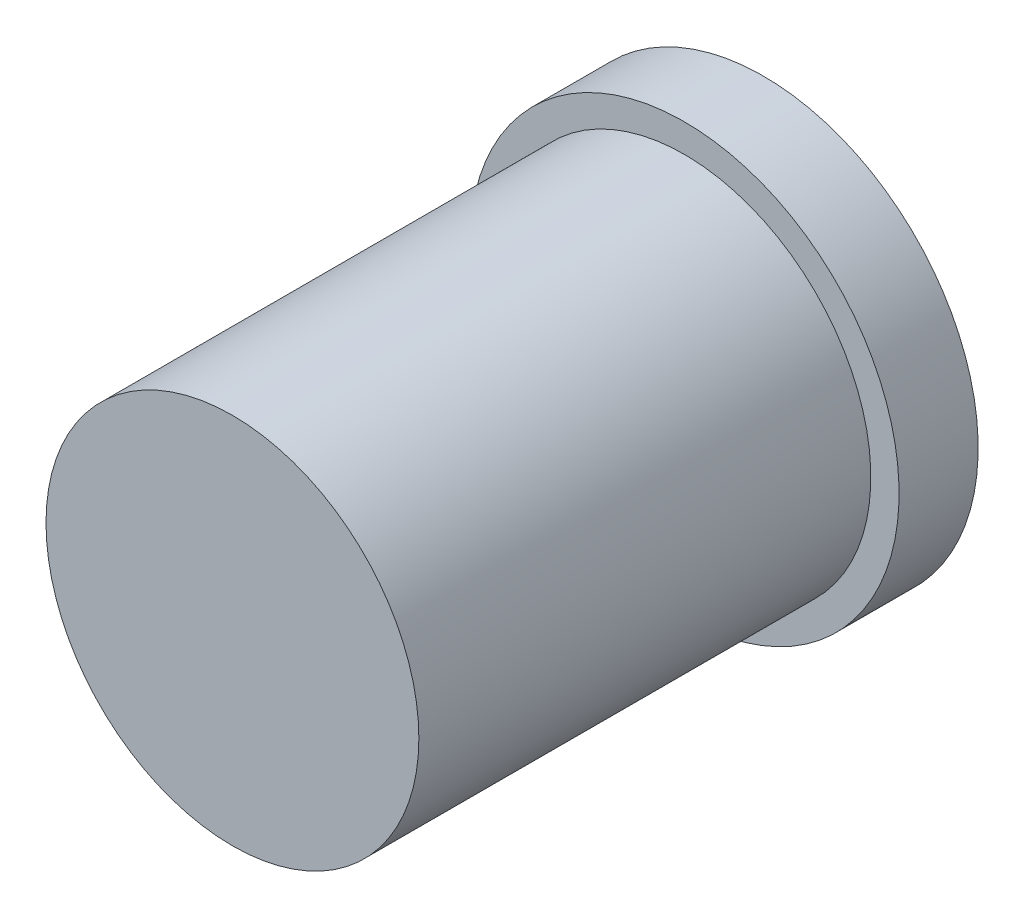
ISO-10303-21;
HEADER;
FILE_DESCRIPTION(('STEP AP214'),'2;1');
FILE_NAME('part.step','',(''),(''),'','','');
FILE_SCHEMA(('AUTOMOTIVE_DESIGN { 1 0 10303 214 1 1 1 1 }'));
ENDSEC;
DATA;
#1=APPLICATION_CONTEXT('core data for automotive mechanical design processes');
#2=APPLICATION_PROTOCOL_DEFINITION('international standard','automotive_design',2000,#1);
#3=PRODUCT_CONTEXT('',#1,'mechanical');
#4=PRODUCT('Part','Part','',(#3));
#5=PRODUCT_RELATED_PRODUCT_CATEGORY('part','',(#4));
#6=PRODUCT_DEFINITION_FORMATION('','',#4);
#7=PRODUCT_DEFINITION_CONTEXT('part definition',#1,'design');
#8=PRODUCT_DEFINITION('design','',#6,#7);
#9=PRODUCT_DEFINITION_SHAPE('','',#8);
#10=(LENGTH_UNIT() NAMED_UNIT(*) SI_UNIT(.MILLI.,.METRE.));
#11=(NAMED_UNIT(*) PLANE_ANGLE_UNIT() SI_UNIT($,.RADIAN.));
#12=(NAMED_UNIT(*) SI_UNIT($,.STERADIAN.) SOLID_ANGLE_UNIT());
#13=UNCERTAINTY_MEASURE_WITH_UNIT(LENGTH_MEASURE(1.E-05),#10,'distance_accuracy_value','');
#14=(GEOMETRIC_REPRESENTATION_CONTEXT(3) GLOBAL_UNCERTAINTY_ASSIGNED_CONTEXT((#13)) GLOBAL_UNIT_ASSIGNED_CONTEXT((#10,
#11,#12)) REPRESENTATION_CONTEXT('',''));
#15=CARTESIAN_POINT('',(0.,0.,0.));
#16=DIRECTION('',(0.,0.,1.));
#17=DIRECTION('',(1.,0.,0.));
#18=AXIS2_PLACEMENT_3D('',#15,#16,#17);
#19=CARTESIAN_POINT('',(0.,0.,-3.50000000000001));
#20=DIRECTION('',(0.,0.,-1.));
#21=DIRECTION('',(-1.,0.,0.));
#22=AXIS2_PLACEMENT_3D('',#19,#20,#21);
#23=PLANE('',#22);
#24=DIRECTION('',(-1.,0.,0.));
#25=VECTOR('',#24,1.);
#26=CARTESIAN_POINT('',(4.49999999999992,4.,-3.50000000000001));
#27=LINE('',#26,#25);
#28=CARTESIAN_POINT('',(4.49999999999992,4.,-3.50000000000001));
#29=VERTEX_POINT('',#28);
#30=CARTESIAN_POINT('',(-4.50000000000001,3.99999999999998,-3.50000000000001));
#31=VERTEX_POINT('',#30);
#32=EDGE_CURVE('E295',#29,#31,#27,.T.);
#33=ORIENTED_EDGE('',*,*,#32,.F.);
#34=CARTESIAN_POINT('',(4.49999999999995,3.5,-3.5));
#35=DIRECTION('',(0.,0.,1.));
#36=DIRECTION('',(-1.,0.,0.));
#37=AXIS2_PLACEMENT_3D('',#34,#35,#36);
#38=CIRCLE('',#37,0.500000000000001);
#39=CARTESIAN_POINT('',(4.99999999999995,3.5,-3.50000000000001));
#40=VERTEX_POINT('',#39);
#41=EDGE_CURVE('E207',#40,#29,#38,.T.);
#42=ORIENTED_EDGE('',*,*,#41,.F.);
#43=DIRECTION('',(0.,1.,0.));
#44=VECTOR('',#43,1.);
#45=CARTESIAN_POINT('',(4.99999999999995,3.5,-3.50000000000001));
#46=LINE('',#45,#44);
#47=CARTESIAN_POINT('',(4.99999999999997,1.50000000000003,-3.50000000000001));
#48=VERTEX_POINT('',#47);
#49=EDGE_CURVE('E315',#48,#40,#46,.T.);
#50=ORIENTED_EDGE('',*,*,#49,.F.);
#51=CARTESIAN_POINT('',(5.99999999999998,1.50000000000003,-3.5));
#52=DIRECTION('',(0.,0.,-1.));
#53=DIRECTION('',(1.,0.,0.));
#54=AXIS2_PLACEMENT_3D('',#51,#52,#53);
#55=CIRCLE('',#54,1.);
#56=CARTESIAN_POINT('',(6.,0.5,-3.5));
#57=VERTEX_POINT('',#56);
#58=EDGE_CURVE('E313',#57,#48,#55,.T.);
#59=ORIENTED_EDGE('',*,*,#58,.F.);
#60=DIRECTION('',(-1.,0.,0.));
#61=VECTOR('',#60,1.);
#62=CARTESIAN_POINT('',(6.83739716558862,0.5,-3.50000000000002));
#63=LINE('',#62,#61);
#64=CARTESIAN_POINT('',(6.83739716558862,0.5,-3.50000000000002));
#65=VERTEX_POINT('',#64);
#66=EDGE_CURVE('E311',#65,#57,#63,.T.);
#67=ORIENTED_EDGE('',*,*,#66,.F.);
#68=CARTESIAN_POINT('',(6.83739716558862,1.49999999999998,-3.50000000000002));
#69=DIRECTION('',(0.,0.,-1.));
#70=DIRECTION('',(1.,0.,0.));
#71=AXIS2_PLACEMENT_3D('',#68,#69,#70);
#72=CIRCLE('',#71,1.);
#73=CARTESIAN_POINT('',(7.81416818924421,1.7142857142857,-3.50000000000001));
#74=VERTEX_POINT('',#73);
#75=EDGE_CURVE('E309',#74,#65,#72,.T.);
#76=ORIENTED_EDGE('',*,*,#75,.F.);
#77=CARTESIAN_POINT('',(0.,0.,-3.50000000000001));
#78=DIRECTION('',(0.,0.,-1.));
#79=DIRECTION('',(-1.,0.,0.));
#80=AXIS2_PLACEMENT_3D('',#77,#78,#79);
#81=CIRCLE('',#80,8.);
#82=CARTESIAN_POINT('',(-7.81416818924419,1.7142857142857,-3.50000000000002));
#83=VERTEX_POINT('',#82);
#84=EDGE_CURVE('E307',#83,#74,#81,.T.);
#85=ORIENTED_EDGE('',*,*,#84,.F.);
#86=CARTESIAN_POINT('',(-6.83739716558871,1.50000000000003,-3.50000000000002));
#87=DIRECTION('',(0.,0.,-1.));
#88=DIRECTION('',(-1.,0.,0.));
#89=AXIS2_PLACEMENT_3D('',#86,#87,#88);
#90=CIRCLE('',#89,1.);
#91=CARTESIAN_POINT('',(-6.83739716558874,0.5,-3.50000000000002));
#92=VERTEX_POINT('',#91);
#93=EDGE_CURVE('E305',#92,#83,#90,.T.);
#94=ORIENTED_EDGE('',*,*,#93,.F.);
#95=DIRECTION('',(-1.,0.,0.));
#96=VECTOR('',#95,1.);
#97=CARTESIAN_POINT('',(-6.00000000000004,0.500000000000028,-3.50000000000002));
#98=LINE('',#97,#96);
#99=CARTESIAN_POINT('',(-6.00000000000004,0.500000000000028,-3.50000000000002));
#100=VERTEX_POINT('',#99);
#101=EDGE_CURVE('E303',#100,#92,#98,.T.);
#102=ORIENTED_EDGE('',*,*,#101,.F.);
#103=CARTESIAN_POINT('',(-6.00000000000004,1.5,-3.50000000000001));
#104=DIRECTION('',(0.,0.,-1.));
#105=DIRECTION('',(1.,0.,0.));
#106=AXIS2_PLACEMENT_3D('',#103,#104,#105);
#107=CIRCLE('',#106,0.999999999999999);
#108=CARTESIAN_POINT('',(-5.00000000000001,1.50000000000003,-3.50000000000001));
#109=VERTEX_POINT('',#108);
#110=EDGE_CURVE('E301',#109,#100,#107,.T.);
#111=ORIENTED_EDGE('',*,*,#110,.F.);
#112=DIRECTION('',(0.,-1.,0.));
#113=VECTOR('',#112,1.);
#114=CARTESIAN_POINT('',(-5.00000000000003,3.49999999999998,-3.50000000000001));
#115=LINE('',#114,#113);
#116=CARTESIAN_POINT('',(-5.00000000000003,3.49999999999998,-3.50000000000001));
#117=VERTEX_POINT('',#116);
#118=EDGE_CURVE('E299',#117,#109,#115,.T.);
#119=ORIENTED_EDGE('',*,*,#118,.F.);
#120=CARTESIAN_POINT('',(-4.50000000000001,3.49999999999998,-3.50000000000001));
#121=DIRECTION('',(0.,0.,1.));
#122=DIRECTION('',(-1.,0.,0.));
#123=AXIS2_PLACEMENT_3D('',#120,#121,#122);
#124=CIRCLE('',#123,0.5);
#125=EDGE_CURVE('E297',#31,#117,#124,.T.);
#126=ORIENTED_EDGE('',*,*,#125,.F.);
#127=EDGE_LOOP('',(#33,#42,#50,#59,#67,#76,#85,#94,#102,#111,#119,#126));
#128=FACE_BOUND('',#127,.T.);
#129=CARTESIAN_POINT('',(0.,0.,-3.50000000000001));
#130=DIRECTION('',(0.,0.,-1.));
#131=DIRECTION('',(-1.,0.,0.));
#132=AXIS2_PLACEMENT_3D('',#129,#130,#131);
#133=CIRCLE('',#132,9.5);
#134=CARTESIAN_POINT('',(-9.5,0.,-3.50000000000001));
#135=VERTEX_POINT('',#134);
#136=EDGE_CURVE('E378',#135,#135,#133,.T.);
#137=ORIENTED_EDGE('',*,*,#136,.T.);
#138=EDGE_LOOP('',(#137));
#139=FACE_BOUND('',#138,.T.);
#140=DIRECTION('',(1.,0.,0.));
#141=VECTOR('',#140,1.);
#142=CARTESIAN_POINT('',(4.5,-4.,-3.50000000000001));
#143=LINE('',#142,#141);
#144=CARTESIAN_POINT('',(-4.50000000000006,-4.00000000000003,-3.50000000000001));
#145=VERTEX_POINT('',#144);
#146=CARTESIAN_POINT('',(4.5,-4.,-3.50000000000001));
#147=VERTEX_POINT('',#146);
#148=EDGE_CURVE('E201',#145,#147,#143,.T.);
#149=ORIENTED_EDGE('',*,*,#148,.F.);
#150=CARTESIAN_POINT('',(-4.49999999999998,-3.49999999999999,-3.50000000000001));
#151=DIRECTION('',(0.,0.,1.));
#152=DIRECTION('',(-1.,0.,0.));
#153=AXIS2_PLACEMENT_3D('',#150,#151,#152);
#154=CIRCLE('',#153,0.5);
#155=CARTESIAN_POINT('',(-5.00000000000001,-3.49999999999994,-3.50000000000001));
#156=VERTEX_POINT('',#155);
#157=EDGE_CURVE('E212',#156,#145,#154,.T.);
#158=ORIENTED_EDGE('',*,*,#157,.F.);
#159=DIRECTION('',(0.,-1.,0.));
#160=VECTOR('',#159,1.);
#161=CARTESIAN_POINT('',(-5.00000000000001,-1.49999999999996,-3.50000000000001));
#162=LINE('',#161,#160);
#163=CARTESIAN_POINT('',(-5.00000000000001,-1.49999999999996,-3.50000000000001));
#164=VERTEX_POINT('',#163);
#165=EDGE_CURVE('E241',#164,#156,#162,.T.);
#166=ORIENTED_EDGE('',*,*,#165,.F.);
#167=CARTESIAN_POINT('',(-6.00000000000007,-1.49999999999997,-3.5));
#168=DIRECTION('',(0.,0.,-1.));
#169=DIRECTION('',(1.,0.,0.));
#170=AXIS2_PLACEMENT_3D('',#167,#168,#169);
#171=CIRCLE('',#170,1.);
#172=CARTESIAN_POINT('',(-6.00000000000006,-0.5,-3.50000000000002));
#173=VERTEX_POINT('',#172);
#174=EDGE_CURVE('E239',#173,#164,#171,.T.);
#175=ORIENTED_EDGE('',*,*,#174,.F.);
#176=DIRECTION('',(1.,0.,0.));
#177=VECTOR('',#176,1.);
#178=CARTESIAN_POINT('',(-6.00000000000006,-0.5,-3.50000000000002));
#179=LINE('',#178,#177);
#180=CARTESIAN_POINT('',(-6.83739716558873,-0.499999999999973,-3.50000000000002));
#181=VERTEX_POINT('',#180);
#182=EDGE_CURVE('E237',#181,#173,#179,.T.);
#183=ORIENTED_EDGE('',*,*,#182,.F.);
#184=CARTESIAN_POINT('',(-6.83739716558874,-1.5,-3.50000000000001));
#185=DIRECTION('',(0.,0.,-1.));
#186=DIRECTION('',(-1.,0.,0.));
#187=AXIS2_PLACEMENT_3D('',#184,#185,#186);
#188=CIRCLE('',#187,1.);
#189=CARTESIAN_POINT('',(-7.81416818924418,-1.71428571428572,-3.5));
#190=VERTEX_POINT('',#189);
#191=EDGE_CURVE('E235',#190,#181,#188,.T.);
#192=ORIENTED_EDGE('',*,*,#191,.F.);
#193=CARTESIAN_POINT('',(0.,0.,-3.50000000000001));
#194=DIRECTION('',(0.,0.,-1.));
#195=DIRECTION('',(-1.,0.,0.));
#196=AXIS2_PLACEMENT_3D('',#193,#194,#195);
#197=CIRCLE('',#196,8.);
#198=CARTESIAN_POINT('',(7.81416818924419,-1.71428571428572,-3.50000000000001));
#199=VERTEX_POINT('',#198);
#200=EDGE_CURVE('E233',#199,#190,#197,.T.);
#201=ORIENTED_EDGE('',*,*,#200,.F.);
#202=CARTESIAN_POINT('',(6.83739716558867,-1.5,-3.50000000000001));
#203=DIRECTION('',(0.,0.,-1.));
#204=DIRECTION('',(1.,0.,0.));
#205=AXIS2_PLACEMENT_3D('',#202,#203,#204);
#206=CIRCLE('',#205,1.);
#207=CARTESIAN_POINT('',(6.83739716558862,-0.500000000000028,-3.50000000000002));
#208=VERTEX_POINT('',#207);
#209=EDGE_CURVE('E231',#208,#199,#206,.T.);
#210=ORIENTED_EDGE('',*,*,#209,.F.);
#211=DIRECTION('',(1.,0.,0.));
#212=VECTOR('',#211,1.);
#213=CARTESIAN_POINT('',(6.83739716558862,-0.500000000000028,-3.50000000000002));
#214=LINE('',#213,#212);
#215=CARTESIAN_POINT('',(6.00000000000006,-0.500000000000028,-3.5));
#216=VERTEX_POINT('',#215);
#217=EDGE_CURVE('E229',#216,#208,#214,.T.);
#218=ORIENTED_EDGE('',*,*,#217,.F.);
#219=CARTESIAN_POINT('',(6.00000000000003,-1.5,-3.5));
#220=DIRECTION('',(0.,0.,-1.));
#221=DIRECTION('',(-1.,0.,0.));
#222=AXIS2_PLACEMENT_3D('',#219,#220,#221);
#223=CIRCLE('',#222,1.);
#224=CARTESIAN_POINT('',(4.99999999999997,-1.5,-3.50000000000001));
#225=VERTEX_POINT('',#224);
#226=EDGE_CURVE('E227',#225,#216,#223,.T.);
#227=ORIENTED_EDGE('',*,*,#226,.F.);
#228=DIRECTION('',(0.,1.,0.));
#229=VECTOR('',#228,1.);
#230=CARTESIAN_POINT('',(4.99999999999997,-1.5,-3.50000000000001));
#231=LINE('',#230,#229);
#232=CARTESIAN_POINT('',(4.99999999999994,-3.49999999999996,-3.50000000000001));
#233=VERTEX_POINT('',#232);
#234=EDGE_CURVE('E223',#233,#225,#231,.T.);
#235=ORIENTED_EDGE('',*,*,#234,.F.);
#236=CARTESIAN_POINT('',(4.5,-3.49999999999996,-3.50000000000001));
#237=DIRECTION('',(0.,0.,1.));
#238=DIRECTION('',(1.,0.,0.));
#239=AXIS2_PLACEMENT_3D('',#236,#237,#238);
#240=CIRCLE('',#239,0.5);
#241=EDGE_CURVE('E221',#147,#233,#240,.T.);
#242=ORIENTED_EDGE('',*,*,#241,.F.);
#243=EDGE_LOOP('',(#149,#158,#166,#175,#183,#192,#201,#210,#218,#227,#235,#242));
#244=FACE_BOUND('',#243,.T.);
#245=ADVANCED_FACE('F34',(#128,#139,#244),#23,.T.);
#246=CARTESIAN_POINT('',(0.,0.,20.));
#247=DIRECTION('',(0.,0.,-1.));
#248=DIRECTION('',(-1.,0.,0.));
#249=AXIS2_PLACEMENT_3D('',#246,#247,#248);
#250=CYLINDRICAL_SURFACE('',#249,8.25);
#251=CARTESIAN_POINT('',(0.,0.,20.));
#252=DIRECTION('',(0.,0.,1.));
#253=DIRECTION('',(1.,0.,0.));
#254=AXIS2_PLACEMENT_3D('',#251,#252,#253);
#255=CIRCLE('',#254,8.25);
#256=CARTESIAN_POINT('',(8.25,0.,20.));
#257=VERTEX_POINT('',#256);
#258=EDGE_CURVE('E11',#257,#257,#255,.T.);
#259=ORIENTED_EDGE('',*,*,#258,.F.);
#260=EDGE_LOOP('',(#259));
#261=FACE_BOUND('',#260,.T.);
#262=CARTESIAN_POINT('',(0.,0.,0.));
#263=DIRECTION('',(0.,0.,-1.));
#264=DIRECTION('',(-1.,0.,0.));
#265=AXIS2_PLACEMENT_3D('',#262,#263,#264);
#266=CIRCLE('',#265,8.25);
#267=CARTESIAN_POINT('',(-8.25,0.,0.));
#268=VERTEX_POINT('',#267);
#269=EDGE_CURVE('E42',#268,#268,#266,.T.);
#270=ORIENTED_EDGE('',*,*,#269,.F.);
#271=EDGE_LOOP('',(#270));
#272=FACE_BOUND('',#271,.T.);
#273=ADVANCED_FACE('F36',(#261,#272),#250,.T.);
#274=CARTESIAN_POINT('',(0.,0.,20.));
#275=DIRECTION('',(0.,0.,1.));
#276=DIRECTION('',(1.,0.,0.));
#277=AXIS2_PLACEMENT_3D('',#274,#275,#276);
#278=PLANE('',#277);
#279=ORIENTED_EDGE('',*,*,#258,.T.);
#280=EDGE_LOOP('',(#279));
#281=FACE_BOUND('',#280,.T.);
#282=ADVANCED_FACE('F386',(#281),#278,.T.);
#283=CARTESIAN_POINT('',(0.,0.,0.));
#284=DIRECTION('',(0.,0.,-1.));
#285=DIRECTION('',(-1.,0.,0.));
#286=AXIS2_PLACEMENT_3D('',#283,#284,#285);
#287=PLANE('',#286);
#288=CARTESIAN_POINT('',(0.,0.,0.));
#289=DIRECTION('',(0.,0.,-1.));
#290=DIRECTION('',(-1.,0.,0.));
#291=AXIS2_PLACEMENT_3D('',#288,#289,#290);
#292=CIRCLE('',#291,9.5);
#293=CARTESIAN_POINT('',(-9.5,0.,0.));
#294=VERTEX_POINT('',#293);
#295=EDGE_CURVE('E375',#294,#294,#292,.T.);
#296=ORIENTED_EDGE('',*,*,#295,.F.);
#297=EDGE_LOOP('',(#296));
#298=FACE_BOUND('',#297,.T.);
#299=ORIENTED_EDGE('',*,*,#269,.T.);
#300=EDGE_LOOP('',(#299));
#301=FACE_BOUND('',#300,.T.);
#302=ADVANCED_FACE('F383',(#298,#301),#287,.F.);
#303=CARTESIAN_POINT('',(0.,0.,-3.50000000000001));
#304=DIRECTION('',(0.,0.,1.));
#305=DIRECTION('',(1.,0.,0.));
#306=AXIS2_PLACEMENT_3D('',#303,#304,#305);
#307=CYLINDRICAL_SURFACE('',#306,9.5);
#308=ORIENTED_EDGE('',*,*,#136,.F.);
#309=EDGE_LOOP('',(#308));
#310=FACE_BOUND('',#309,.T.);
#311=ORIENTED_EDGE('',*,*,#295,.T.);
#312=EDGE_LOOP('',(#311));
#313=FACE_BOUND('',#312,.T.);
#314=ADVANCED_FACE('F403',(#310,#313),#307,.T.);
#315=CARTESIAN_POINT('',(4.50000000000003,3.49999999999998,-4.50000000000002));
#316=DIRECTION('',(0.,0.,1.));
#317=DIRECTION('',(1.,0.,0.));
#318=AXIS2_PLACEMENT_3D('',#315,#316,#317);
#319=CYLINDRICAL_SURFACE('',#318,0.500000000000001);
#320=ORIENTED_EDGE('',*,*,#41,.T.);
#321=DIRECTION('',(0.,0.,1.));
#322=VECTOR('',#321,1.);
#323=CARTESIAN_POINT('',(4.49999999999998,3.99999999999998,-4.50000000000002));
#324=LINE('',#323,#322);
#325=CARTESIAN_POINT('',(4.49999999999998,3.99999999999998,-4.50000000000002));
#326=VERTEX_POINT('',#325);
#327=EDGE_CURVE('E373',#326,#29,#324,.T.);
#328=ORIENTED_EDGE('',*,*,#327,.F.);
#329=CARTESIAN_POINT('',(4.50000000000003,3.49999999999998,-4.50000000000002));
#330=DIRECTION('',(0.,0.,1.));
#331=DIRECTION('',(-1.,0.,0.));
#332=AXIS2_PLACEMENT_3D('',#329,#330,#331);
#333=CIRCLE('',#332,0.500000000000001);
#334=CARTESIAN_POINT('',(5.00000000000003,3.5,-4.50000000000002));
#335=VERTEX_POINT('',#334);
#336=EDGE_CURVE('E317',#335,#326,#333,.T.);
#337=ORIENTED_EDGE('',*,*,#336,.F.);
#338=DIRECTION('',(0.,0.,1.));
#339=VECTOR('',#338,1.);
#340=CARTESIAN_POINT('',(5.00000000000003,3.5,-4.50000000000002));
#341=LINE('',#340,#339);
#342=EDGE_CURVE('E342',#335,#40,#341,.T.);
#343=ORIENTED_EDGE('',*,*,#342,.T.);
#344=EDGE_LOOP('',(#320,#328,#337,#343));
#345=FACE_BOUND('',#344,.T.);
#346=ADVANCED_FACE('F405',(#345),#319,.F.);
#347=CARTESIAN_POINT('',(4.49999999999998,3.99999999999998,-4.50000000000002));
#348=DIRECTION('',(0.,1.,0.));
#349=DIRECTION('',(0.,0.,1.));
#350=AXIS2_PLACEMENT_3D('',#347,#348,#349);
#351=PLANE('',#350);
#352=ORIENTED_EDGE('',*,*,#32,.T.);
#353=DIRECTION('',(0.,0.,1.));
#354=VECTOR('',#353,1.);
#355=CARTESIAN_POINT('',(-4.50000000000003,3.99999999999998,-4.50000000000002));
#356=LINE('',#355,#354);
#357=CARTESIAN_POINT('',(-4.50000000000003,3.99999999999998,-4.50000000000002));
#358=VERTEX_POINT('',#357);
#359=EDGE_CURVE('E370',#358,#31,#356,.T.);
#360=ORIENTED_EDGE('',*,*,#359,.F.);
#361=DIRECTION('',(-1.,0.,0.));
#362=VECTOR('',#361,1.);
#363=CARTESIAN_POINT('',(4.49999999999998,3.99999999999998,-4.50000000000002));
#364=LINE('',#363,#362);
#365=EDGE_CURVE('E320',#326,#358,#364,.T.);
#366=ORIENTED_EDGE('',*,*,#365,.F.);
#367=ORIENTED_EDGE('',*,*,#327,.T.);
#368=EDGE_LOOP('',(#352,#360,#366,#367));
#369=FACE_BOUND('',#368,.T.);
#370=ADVANCED_FACE('F411',(#369),#351,.F.);
#371=CARTESIAN_POINT('',(-4.50000000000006,3.5,-4.50000000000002));
#372=DIRECTION('',(0.,0.,1.));
#373=DIRECTION('',(1.,0.,0.));
#374=AXIS2_PLACEMENT_3D('',#371,#372,#373);
#375=CYLINDRICAL_SURFACE('',#374,0.5);
#376=ORIENTED_EDGE('',*,*,#125,.T.);
#377=DIRECTION('',(0.,0.,1.));
#378=VECTOR('',#377,1.);
#379=CARTESIAN_POINT('',(-5.00000000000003,3.5,-4.5));
#380=LINE('',#379,#378);
#381=CARTESIAN_POINT('',(-5.00000000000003,3.5,-4.5));
#382=VERTEX_POINT('',#381);
#383=EDGE_CURVE('E367',#382,#117,#380,.T.);
#384=ORIENTED_EDGE('',*,*,#383,.F.);
#385=CARTESIAN_POINT('',(-4.50000000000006,3.5,-4.50000000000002));
#386=DIRECTION('',(0.,0.,1.));
#387=DIRECTION('',(-1.,0.,0.));
#388=AXIS2_PLACEMENT_3D('',#385,#386,#387);
#389=CIRCLE('',#388,0.5);
#390=EDGE_CURVE('E322',#358,#382,#389,.T.);
#391=ORIENTED_EDGE('',*,*,#390,.F.);
#392=ORIENTED_EDGE('',*,*,#359,.T.);
#393=EDGE_LOOP('',(#376,#384,#391,#392));
#394=FACE_BOUND('',#393,.T.);
#395=ADVANCED_FACE('F449',(#394),#375,.F.);
#396=CARTESIAN_POINT('',(-5.00000000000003,3.5,-4.5));
#397=DIRECTION('',(-1.,0.,0.));
#398=DIRECTION('',(0.,-1.,0.));
#399=AXIS2_PLACEMENT_3D('',#396,#397,#398);
#400=PLANE('',#399);
#401=ORIENTED_EDGE('',*,*,#118,.T.);
#402=DIRECTION('',(0.,0.,1.));
#403=VECTOR('',#402,1.);
#404=CARTESIAN_POINT('',(-4.99999999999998,1.50000000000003,-4.50000000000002));
#405=LINE('',#404,#403);
#406=CARTESIAN_POINT('',(-4.99999999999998,1.50000000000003,-4.50000000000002));
#407=VERTEX_POINT('',#406);
#408=EDGE_CURVE('E364',#407,#109,#405,.T.);
#409=ORIENTED_EDGE('',*,*,#408,.F.);
#410=DIRECTION('',(0.,-1.,0.));
#411=VECTOR('',#410,1.);
#412=CARTESIAN_POINT('',(-5.00000000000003,3.5,-4.5));
#413=LINE('',#412,#411);
#414=EDGE_CURVE('E324',#382,#407,#413,.T.);
#415=ORIENTED_EDGE('',*,*,#414,.F.);
#416=ORIENTED_EDGE('',*,*,#383,.T.);
#417=EDGE_LOOP('',(#401,#409,#415,#416));
#418=FACE_BOUND('',#417,.T.);
#419=ADVANCED_FACE('F458',(#418),#400,.F.);
#420=CARTESIAN_POINT('',(-6.00000000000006,1.50000000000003,-4.50000000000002));
#421=DIRECTION('',(0.,0.,1.));
#422=DIRECTION('',(1.,0.,0.));
#423=AXIS2_PLACEMENT_3D('',#420,#421,#422);
#424=CYLINDRICAL_SURFACE('',#423,0.999999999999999);
#425=ORIENTED_EDGE('',*,*,#110,.T.);
#426=DIRECTION('',(0.,0.,1.));
#427=VECTOR('',#426,1.);
#428=CARTESIAN_POINT('',(-6.00000000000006,0.5,-4.50000000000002));
#429=LINE('',#428,#427);
#430=CARTESIAN_POINT('',(-6.00000000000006,0.5,-4.50000000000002));
#431=VERTEX_POINT('',#430);
#432=EDGE_CURVE('E361',#431,#100,#429,.T.);
#433=ORIENTED_EDGE('',*,*,#432,.F.);
#434=CARTESIAN_POINT('',(-6.00000000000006,1.50000000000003,-4.50000000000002));
#435=DIRECTION('',(0.,0.,-1.));
#436=DIRECTION('',(1.,0.,0.));
#437=AXIS2_PLACEMENT_3D('',#434,#435,#436);
#438=CIRCLE('',#437,0.999999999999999);
#439=EDGE_CURVE('E326',#407,#431,#438,.T.);
#440=ORIENTED_EDGE('',*,*,#439,.F.);
#441=ORIENTED_EDGE('',*,*,#408,.T.);
#442=EDGE_LOOP('',(#425,#433,#440,#441));
#443=FACE_BOUND('',#442,.T.);
#444=ADVANCED_FACE('F467',(#443),#424,.T.);
#445=CARTESIAN_POINT('',(-6.00000000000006,0.5,-4.50000000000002));
#446=DIRECTION('',(0.,1.,0.));
#447=DIRECTION('',(-1.,0.,0.));
#448=AXIS2_PLACEMENT_3D('',#445,#446,#447);
#449=PLANE('',#448);
#450=ORIENTED_EDGE('',*,*,#101,.T.);
#451=DIRECTION('',(0.,0.,1.));
#452=VECTOR('',#451,1.);
#453=CARTESIAN_POINT('',(-6.83739716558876,0.500000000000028,-4.50000000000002));
#454=LINE('',#453,#452);
#455=CARTESIAN_POINT('',(-6.83739716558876,0.500000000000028,-4.50000000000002));
#456=VERTEX_POINT('',#455);
#457=EDGE_CURVE('E358',#456,#92,#454,.T.);
#458=ORIENTED_EDGE('',*,*,#457,.F.);
#459=DIRECTION('',(-1.,0.,0.));
#460=VECTOR('',#459,1.);
#461=CARTESIAN_POINT('',(-6.00000000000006,0.5,-4.50000000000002));
#462=LINE('',#461,#460);
#463=EDGE_CURVE('E328',#431,#456,#462,.T.);
#464=ORIENTED_EDGE('',*,*,#463,.F.);
#465=ORIENTED_EDGE('',*,*,#432,.T.);
#466=EDGE_LOOP('',(#450,#458,#464,#465));
#467=FACE_BOUND('',#466,.T.);
#468=ADVANCED_FACE('F476',(#467),#449,.F.);
#469=CARTESIAN_POINT('',(-6.83739716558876,1.50000000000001,-4.50000000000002));
#470=DIRECTION('',(0.,0.,1.));
#471=DIRECTION('',(1.,0.,0.));
#472=AXIS2_PLACEMENT_3D('',#469,#470,#471);
#473=CYLINDRICAL_SURFACE('',#472,1.);
#474=ORIENTED_EDGE('',*,*,#93,.T.);
#475=DIRECTION('',(0.,0.,1.));
#476=VECTOR('',#475,1.);
#477=CARTESIAN_POINT('',(-7.81416818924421,1.7142857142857,-4.50000000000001));
#478=LINE('',#477,#476);
#479=CARTESIAN_POINT('',(-7.81416818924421,1.7142857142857,-4.50000000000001));
#480=VERTEX_POINT('',#479);
#481=EDGE_CURVE('E355',#480,#83,#478,.T.);
#482=ORIENTED_EDGE('',*,*,#481,.F.);
#483=CARTESIAN_POINT('',(-6.83739716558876,1.50000000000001,-4.50000000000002));
#484=DIRECTION('',(0.,0.,-1.));
#485=DIRECTION('',(-1.,0.,0.));
#486=AXIS2_PLACEMENT_3D('',#483,#484,#485);
#487=CIRCLE('',#486,1.);
#488=EDGE_CURVE('E330',#456,#480,#487,.T.);
#489=ORIENTED_EDGE('',*,*,#488,.F.);
#490=ORIENTED_EDGE('',*,*,#457,.T.);
#491=EDGE_LOOP('',(#474,#482,#489,#490));
#492=FACE_BOUND('',#491,.T.);
#493=ADVANCED_FACE('F485',(#492),#473,.T.);
#494=CARTESIAN_POINT('',(0.,0.,-4.50000000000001));
#495=DIRECTION('',(0.,0.,1.));
#496=DIRECTION('',(1.,0.,0.));
#497=AXIS2_PLACEMENT_3D('',#494,#495,#496);
#498=CYLINDRICAL_SURFACE('',#497,8.);
#499=ORIENTED_EDGE('',*,*,#84,.T.);
#500=DIRECTION('',(0.,0.,1.));
#501=VECTOR('',#500,1.);
#502=CARTESIAN_POINT('',(7.81416818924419,1.7142857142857,-4.5));
#503=LINE('',#502,#501);
#504=CARTESIAN_POINT('',(7.81416818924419,1.7142857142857,-4.5));
#505=VERTEX_POINT('',#504);
#506=EDGE_CURVE('E352',#505,#74,#503,.T.);
#507=ORIENTED_EDGE('',*,*,#506,.F.);
#508=CARTESIAN_POINT('',(0.,0.,-4.50000000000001));
#509=DIRECTION('',(0.,0.,-1.));
#510=DIRECTION('',(-1.,0.,0.));
#511=AXIS2_PLACEMENT_3D('',#508,#509,#510);
#512=CIRCLE('',#511,8.);
#513=EDGE_CURVE('E332',#480,#505,#512,.T.);
#514=ORIENTED_EDGE('',*,*,#513,.F.);
#515=ORIENTED_EDGE('',*,*,#481,.T.);
#516=EDGE_LOOP('',(#499,#507,#514,#515));
#517=FACE_BOUND('',#516,.T.);
#518=ADVANCED_FACE('F494',(#517),#498,.T.);
#519=CARTESIAN_POINT('',(6.83739716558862,1.50000000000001,-4.50000000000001));
#520=DIRECTION('',(0.,0.,1.));
#521=DIRECTION('',(1.,0.,0.));
#522=AXIS2_PLACEMENT_3D('',#519,#520,#521);
#523=CYLINDRICAL_SURFACE('',#522,1.);
#524=ORIENTED_EDGE('',*,*,#75,.T.);
#525=DIRECTION('',(0.,0.,1.));
#526=VECTOR('',#525,1.);
#527=CARTESIAN_POINT('',(6.83739716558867,0.499999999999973,-4.50000000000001));
#528=LINE('',#527,#526);
#529=CARTESIAN_POINT('',(6.83739716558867,0.499999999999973,-4.50000000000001));
#530=VERTEX_POINT('',#529);
#531=EDGE_CURVE('E349',#530,#65,#528,.T.);
#532=ORIENTED_EDGE('',*,*,#531,.F.);
#533=CARTESIAN_POINT('',(6.83739716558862,1.50000000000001,-4.50000000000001));
#534=DIRECTION('',(0.,0.,-1.));
#535=DIRECTION('',(1.,0.,0.));
#536=AXIS2_PLACEMENT_3D('',#533,#534,#535);
#537=CIRCLE('',#536,1.);
#538=EDGE_CURVE('E334',#505,#530,#537,.T.);
#539=ORIENTED_EDGE('',*,*,#538,.F.);
#540=ORIENTED_EDGE('',*,*,#506,.T.);
#541=EDGE_LOOP('',(#524,#532,#539,#540));
#542=FACE_BOUND('',#541,.T.);
#543=ADVANCED_FACE('F503',(#542),#523,.T.);
#544=CARTESIAN_POINT('',(6.83739716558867,0.499999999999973,-4.50000000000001));
#545=DIRECTION('',(0.,1.,0.));
#546=DIRECTION('',(0.,0.,1.));
#547=AXIS2_PLACEMENT_3D('',#544,#545,#546);
#548=PLANE('',#547);
#549=ORIENTED_EDGE('',*,*,#66,.T.);
#550=DIRECTION('',(0.,0.,1.));
#551=VECTOR('',#550,1.);
#552=CARTESIAN_POINT('',(6.00000000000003,0.499999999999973,-4.50000000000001));
#553=LINE('',#552,#551);
#554=CARTESIAN_POINT('',(6.00000000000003,0.499999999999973,-4.50000000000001));
#555=VERTEX_POINT('',#554);
#556=EDGE_CURVE('E346',#555,#57,#553,.T.);
#557=ORIENTED_EDGE('',*,*,#556,.F.);
#558=DIRECTION('',(-1.,0.,0.));
#559=VECTOR('',#558,1.);
#560=CARTESIAN_POINT('',(6.83739716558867,0.499999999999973,-4.50000000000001));
#561=LINE('',#560,#559);
#562=EDGE_CURVE('E336',#530,#555,#561,.T.);
#563=ORIENTED_EDGE('',*,*,#562,.F.);
#564=ORIENTED_EDGE('',*,*,#531,.T.);
#565=EDGE_LOOP('',(#549,#557,#563,#564));
#566=FACE_BOUND('',#565,.T.);
#567=ADVANCED_FACE('F512',(#566),#548,.F.);
#568=CARTESIAN_POINT('',(6.00000000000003,1.50000000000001,-4.50000000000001));
#569=DIRECTION('',(0.,0.,1.));
#570=DIRECTION('',(1.,0.,0.));
#571=AXIS2_PLACEMENT_3D('',#568,#569,#570);
#572=CYLINDRICAL_SURFACE('',#571,1.);
#573=ORIENTED_EDGE('',*,*,#58,.T.);
#574=DIRECTION('',(0.,0.,1.));
#575=VECTOR('',#574,1.);
#576=CARTESIAN_POINT('',(4.99999999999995,1.5,-4.50000000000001));
#577=LINE('',#576,#575);
#578=CARTESIAN_POINT('',(4.99999999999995,1.5,-4.50000000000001));
#579=VERTEX_POINT('',#578);
#580=EDGE_CURVE('E57',#579,#48,#577,.T.);
#581=ORIENTED_EDGE('',*,*,#580,.F.);
#582=CARTESIAN_POINT('',(6.00000000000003,1.50000000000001,-4.50000000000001));
#583=DIRECTION('',(0.,0.,-1.));
#584=DIRECTION('',(1.,0.,0.));
#585=AXIS2_PLACEMENT_3D('',#582,#583,#584);
#586=CIRCLE('',#585,1.);
#587=EDGE_CURVE('E338',#555,#579,#586,.T.);
#588=ORIENTED_EDGE('',*,*,#587,.F.);
#589=ORIENTED_EDGE('',*,*,#556,.T.);
#590=EDGE_LOOP('',(#573,#581,#588,#589));
#591=FACE_BOUND('',#590,.T.);
#592=ADVANCED_FACE('F521',(#591),#572,.T.);
#593=CARTESIAN_POINT('',(5.00000000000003,3.5,-4.50000000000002));
#594=DIRECTION('',(1.,0.,0.));
#595=DIRECTION('',(0.,0.,-1.));
#596=AXIS2_PLACEMENT_3D('',#593,#594,#595);
#597=PLANE('',#596);
#598=ORIENTED_EDGE('',*,*,#49,.T.);
#599=ORIENTED_EDGE('',*,*,#342,.F.);
#600=DIRECTION('',(0.,1.,0.));
#601=VECTOR('',#600,1.);
#602=CARTESIAN_POINT('',(5.00000000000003,3.5,-4.50000000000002));
#603=LINE('',#602,#601);
#604=EDGE_CURVE('E340',#579,#335,#603,.T.);
#605=ORIENTED_EDGE('',*,*,#604,.F.);
#606=ORIENTED_EDGE('',*,*,#580,.T.);
#607=EDGE_LOOP('',(#598,#599,#605,#606));
#608=FACE_BOUND('',#607,.T.);
#609=ADVANCED_FACE('F530',(#608),#597,.F.);
#610=CARTESIAN_POINT('',(4.50000000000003,3.49999999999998,-4.50000000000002));
#611=DIRECTION('',(0.,0.,-1.));
#612=DIRECTION('',(-1.,0.,0.));
#613=AXIS2_PLACEMENT_3D('',#610,#611,#612);
#614=PLANE('',#613);
#615=ORIENTED_EDGE('',*,*,#336,.T.);
#616=ORIENTED_EDGE('',*,*,#365,.T.);
#617=ORIENTED_EDGE('',*,*,#390,.T.);
#618=ORIENTED_EDGE('',*,*,#414,.T.);
#619=ORIENTED_EDGE('',*,*,#439,.T.);
#620=ORIENTED_EDGE('',*,*,#463,.T.);
#621=ORIENTED_EDGE('',*,*,#488,.T.);
#622=ORIENTED_EDGE('',*,*,#513,.T.);
#623=ORIENTED_EDGE('',*,*,#538,.T.);
#624=ORIENTED_EDGE('',*,*,#562,.T.);
#625=ORIENTED_EDGE('',*,*,#587,.T.);
#626=ORIENTED_EDGE('',*,*,#604,.T.);
#627=EDGE_LOOP('',(#615,#616,#617,#618,#619,#620,#621,#622,#623,#624,#625,#626));
#628=FACE_BOUND('',#627,.T.);
#629=ADVANCED_FACE('F539',(#628),#614,.T.);
#630=CARTESIAN_POINT('',(-4.49999999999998,-3.49999999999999,-4.50000000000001));
#631=DIRECTION('',(0.,0.,1.));
#632=DIRECTION('',(1.,0.,0.));
#633=AXIS2_PLACEMENT_3D('',#630,#631,#632);
#634=CYLINDRICAL_SURFACE('',#633,0.5);
#635=ORIENTED_EDGE('',*,*,#157,.T.);
#636=DIRECTION('',(0.,0.,1.));
#637=VECTOR('',#636,1.);
#638=CARTESIAN_POINT('',(-4.50000000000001,-4.,-4.50000000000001));
#639=LINE('',#638,#637);
#640=CARTESIAN_POINT('',(-4.50000000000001,-4.,-4.50000000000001));
#641=VERTEX_POINT('',#640);
#642=EDGE_CURVE('E196',#641,#145,#639,.T.);
#643=ORIENTED_EDGE('',*,*,#642,.F.);
#644=CARTESIAN_POINT('',(-4.49999999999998,-3.49999999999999,-4.50000000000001));
#645=DIRECTION('',(0.,0.,1.));
#646=DIRECTION('',(-1.,0.,0.));
#647=AXIS2_PLACEMENT_3D('',#644,#645,#646);
#648=CIRCLE('',#647,0.5);
#649=CARTESIAN_POINT('',(-5.00000000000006,-3.49999999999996,-4.5));
#650=VERTEX_POINT('',#649);
#651=EDGE_CURVE('E243',#650,#641,#648,.T.);
#652=ORIENTED_EDGE('',*,*,#651,.F.);
#653=DIRECTION('',(0.,0.,1.));
#654=VECTOR('',#653,1.);
#655=CARTESIAN_POINT('',(-5.00000000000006,-3.49999999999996,-4.5));
#656=LINE('',#655,#654);
#657=EDGE_CURVE('E215',#650,#156,#656,.T.);
#658=ORIENTED_EDGE('',*,*,#657,.T.);
#659=EDGE_LOOP('',(#635,#643,#652,#658));
#660=FACE_BOUND('',#659,.T.);
#661=ADVANCED_FACE('F213',(#660),#634,.F.);
#662=CARTESIAN_POINT('',(4.50000000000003,-4.,-4.50000000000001));
#663=DIRECTION('',(0.,-1.,0.));
#664=DIRECTION('',(0.,0.,-1.));
#665=AXIS2_PLACEMENT_3D('',#662,#663,#664);
#666=PLANE('',#665);
#667=ORIENTED_EDGE('',*,*,#148,.T.);
#668=DIRECTION('',(0.,0.,1.));
#669=VECTOR('',#668,1.);
#670=CARTESIAN_POINT('',(4.50000000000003,-4.,-4.50000000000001));
#671=LINE('',#670,#669);
#672=CARTESIAN_POINT('',(4.50000000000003,-4.,-4.50000000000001));
#673=VERTEX_POINT('',#672);
#674=EDGE_CURVE('E208',#673,#147,#671,.T.);
#675=ORIENTED_EDGE('',*,*,#674,.F.);
#676=DIRECTION('',(1.,0.,0.));
#677=VECTOR('',#676,1.);
#678=CARTESIAN_POINT('',(4.50000000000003,-4.,-4.50000000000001));
#679=LINE('',#678,#677);
#680=EDGE_CURVE('E203',#641,#673,#679,.T.);
#681=ORIENTED_EDGE('',*,*,#680,.F.);
#682=ORIENTED_EDGE('',*,*,#642,.T.);
#683=EDGE_LOOP('',(#667,#675,#681,#682));
#684=FACE_BOUND('',#683,.T.);
#685=ADVANCED_FACE('F198',(#684),#666,.F.);
#686=CARTESIAN_POINT('',(4.5,-3.49999999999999,-4.50000000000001));
#687=DIRECTION('',(0.,0.,1.));
#688=DIRECTION('',(1.,0.,0.));
#689=AXIS2_PLACEMENT_3D('',#686,#687,#688);
#690=CYLINDRICAL_SURFACE('',#689,0.5);
#691=ORIENTED_EDGE('',*,*,#241,.T.);
#692=DIRECTION('',(0.,0.,1.));
#693=VECTOR('',#692,1.);
#694=CARTESIAN_POINT('',(5.,-3.49999999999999,-4.50000000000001));
#695=LINE('',#694,#693);
#696=CARTESIAN_POINT('',(5.,-3.49999999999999,-4.50000000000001));
#697=VERTEX_POINT('',#696);
#698=EDGE_CURVE('E289',#697,#233,#695,.T.);
#699=ORIENTED_EDGE('',*,*,#698,.F.);
#700=CARTESIAN_POINT('',(4.5,-3.49999999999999,-4.50000000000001));
#701=DIRECTION('',(0.,0.,1.));
#702=DIRECTION('',(1.,0.,0.));
#703=AXIS2_PLACEMENT_3D('',#700,#701,#702);
#704=CIRCLE('',#703,0.5);
#705=EDGE_CURVE('E246',#673,#697,#704,.T.);
#706=ORIENTED_EDGE('',*,*,#705,.F.);
#707=ORIENTED_EDGE('',*,*,#674,.T.);
#708=EDGE_LOOP('',(#691,#699,#706,#707));
#709=FACE_BOUND('',#708,.T.);
#710=ADVANCED_FACE('F562',(#709),#690,.F.);
#711=CARTESIAN_POINT('',(4.99999999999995,-1.50000000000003,-4.50000000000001));
#712=DIRECTION('',(1.,0.,0.));
#713=DIRECTION('',(0.,0.,-1.));
#714=AXIS2_PLACEMENT_3D('',#711,#712,#713);
#715=PLANE('',#714);
#716=ORIENTED_EDGE('',*,*,#234,.T.);
#717=DIRECTION('',(0.,0.,1.));
#718=VECTOR('',#717,1.);
#719=CARTESIAN_POINT('',(4.99999999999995,-1.50000000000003,-4.50000000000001));
#720=LINE('',#719,#718);
#721=CARTESIAN_POINT('',(4.99999999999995,-1.50000000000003,-4.50000000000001));
#722=VERTEX_POINT('',#721);
#723=EDGE_CURVE('E286',#722,#225,#720,.T.);
#724=ORIENTED_EDGE('',*,*,#723,.F.);
#725=DIRECTION('',(0.,1.,0.));
#726=VECTOR('',#725,1.);
#727=CARTESIAN_POINT('',(4.99999999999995,-1.50000000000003,-4.50000000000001));
#728=LINE('',#727,#726);
#729=EDGE_CURVE('E248',#697,#722,#728,.T.);
#730=ORIENTED_EDGE('',*,*,#729,.F.);
#731=ORIENTED_EDGE('',*,*,#698,.T.);
#732=EDGE_LOOP('',(#716,#724,#730,#731));
#733=FACE_BOUND('',#732,.T.);
#734=ADVANCED_FACE('F570',(#733),#715,.F.);
#735=CARTESIAN_POINT('',(6.00000000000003,-1.50000000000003,-4.50000000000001));
#736=DIRECTION('',(0.,0.,1.));
#737=DIRECTION('',(1.,0.,0.));
#738=AXIS2_PLACEMENT_3D('',#735,#736,#737);
#739=CYLINDRICAL_SURFACE('',#738,1.);
#740=ORIENTED_EDGE('',*,*,#226,.T.);
#741=DIRECTION('',(0.,0.,1.));
#742=VECTOR('',#741,1.);
#743=CARTESIAN_POINT('',(6.00000000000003,-0.5,-4.50000000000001));
#744=LINE('',#743,#742);
#745=CARTESIAN_POINT('',(6.00000000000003,-0.5,-4.50000000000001));
#746=VERTEX_POINT('',#745);
#747=EDGE_CURVE('E283',#746,#216,#744,.T.);
#748=ORIENTED_EDGE('',*,*,#747,.F.);
#749=CARTESIAN_POINT('',(6.00000000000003,-1.50000000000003,-4.50000000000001));
#750=DIRECTION('',(0.,0.,-1.));
#751=DIRECTION('',(-1.,0.,0.));
#752=AXIS2_PLACEMENT_3D('',#749,#750,#751);
#753=CIRCLE('',#752,1.);
#754=EDGE_CURVE('E250',#722,#746,#753,.T.);
#755=ORIENTED_EDGE('',*,*,#754,.F.);
#756=ORIENTED_EDGE('',*,*,#723,.T.);
#757=EDGE_LOOP('',(#740,#748,#755,#756));
#758=FACE_BOUND('',#757,.T.);
#759=ADVANCED_FACE('F579',(#758),#739,.T.);
#760=CARTESIAN_POINT('',(6.83739716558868,-0.5,-4.50000000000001));
#761=DIRECTION('',(0.,-1.,0.));
#762=DIRECTION('',(0.,0.,-1.));
#763=AXIS2_PLACEMENT_3D('',#760,#761,#762);
#764=PLANE('',#763);
#765=ORIENTED_EDGE('',*,*,#217,.T.);
#766=DIRECTION('',(0.,0.,1.));
#767=VECTOR('',#766,1.);
#768=CARTESIAN_POINT('',(6.83739716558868,-0.5,-4.50000000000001));
#769=LINE('',#768,#767);
#770=CARTESIAN_POINT('',(6.83739716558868,-0.5,-4.50000000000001));
#771=VERTEX_POINT('',#770);
#772=EDGE_CURVE('E280',#771,#208,#769,.T.);
#773=ORIENTED_EDGE('',*,*,#772,.F.);
#774=DIRECTION('',(1.,0.,0.));
#775=VECTOR('',#774,1.);
#776=CARTESIAN_POINT('',(6.83739716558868,-0.5,-4.50000000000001));
#777=LINE('',#776,#775);
#778=EDGE_CURVE('E252',#746,#771,#777,.T.);
#779=ORIENTED_EDGE('',*,*,#778,.F.);
#780=ORIENTED_EDGE('',*,*,#747,.T.);
#781=EDGE_LOOP('',(#765,#773,#779,#780));
#782=FACE_BOUND('',#781,.T.);
#783=ADVANCED_FACE('F588',(#782),#764,.F.);
#784=CARTESIAN_POINT('',(6.83739716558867,-1.50000000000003,-4.5));
#785=DIRECTION('',(0.,0.,1.));
#786=DIRECTION('',(1.,0.,0.));
#787=AXIS2_PLACEMENT_3D('',#784,#785,#786);
#788=CYLINDRICAL_SURFACE('',#787,1.);
#789=ORIENTED_EDGE('',*,*,#209,.T.);
#790=DIRECTION('',(0.,0.,1.));
#791=VECTOR('',#790,1.);
#792=CARTESIAN_POINT('',(7.81416818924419,-1.71428571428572,-4.50000000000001));
#793=LINE('',#792,#791);
#794=CARTESIAN_POINT('',(7.81416818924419,-1.71428571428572,-4.50000000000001));
#795=VERTEX_POINT('',#794);
#796=EDGE_CURVE('E277',#795,#199,#793,.T.);
#797=ORIENTED_EDGE('',*,*,#796,.F.);
#798=CARTESIAN_POINT('',(6.83739716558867,-1.50000000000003,-4.5));
#799=DIRECTION('',(0.,0.,-1.));
#800=DIRECTION('',(1.,0.,0.));
#801=AXIS2_PLACEMENT_3D('',#798,#799,#800);
#802=CIRCLE('',#801,1.);
#803=EDGE_CURVE('E254',#771,#795,#802,.T.);
#804=ORIENTED_EDGE('',*,*,#803,.F.);
#805=ORIENTED_EDGE('',*,*,#772,.T.);
#806=EDGE_LOOP('',(#789,#797,#804,#805));
#807=FACE_BOUND('',#806,.T.);
#808=ADVANCED_FACE('F597',(#807),#788,.T.);
#809=CARTESIAN_POINT('',(0.,0.,-4.50000000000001));
#810=DIRECTION('',(0.,0.,1.));
#811=DIRECTION('',(1.,0.,0.));
#812=AXIS2_PLACEMENT_3D('',#809,#810,#811);
#813=CYLINDRICAL_SURFACE('',#812,8.);
#814=ORIENTED_EDGE('',*,*,#200,.T.);
#815=DIRECTION('',(0.,0.,1.));
#816=VECTOR('',#815,1.);
#817=CARTESIAN_POINT('',(-7.81416818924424,-1.71428571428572,-4.50000000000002));
#818=LINE('',#817,#816);
#819=CARTESIAN_POINT('',(-7.81416818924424,-1.71428571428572,-4.50000000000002));
#820=VERTEX_POINT('',#819);
#821=EDGE_CURVE('E274',#820,#190,#818,.T.);
#822=ORIENTED_EDGE('',*,*,#821,.F.);
#823=CARTESIAN_POINT('',(0.,0.,-4.50000000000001));
#824=DIRECTION('',(0.,0.,-1.));
#825=DIRECTION('',(-1.,0.,0.));
#826=AXIS2_PLACEMENT_3D('',#823,#824,#825);
#827=CIRCLE('',#826,8.);
#828=EDGE_CURVE('E256',#795,#820,#827,.T.);
#829=ORIENTED_EDGE('',*,*,#828,.F.);
#830=ORIENTED_EDGE('',*,*,#796,.T.);
#831=EDGE_LOOP('',(#814,#822,#829,#830));
#832=FACE_BOUND('',#831,.T.);
#833=ADVANCED_FACE('F606',(#832),#813,.T.);
#834=CARTESIAN_POINT('',(-6.83739716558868,-1.5,-4.50000000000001));
#835=DIRECTION('',(0.,0.,1.));
#836=DIRECTION('',(1.,0.,0.));
#837=AXIS2_PLACEMENT_3D('',#834,#835,#836);
#838=CYLINDRICAL_SURFACE('',#837,1.);
#839=ORIENTED_EDGE('',*,*,#191,.T.);
#840=DIRECTION('',(0.,0.,1.));
#841=VECTOR('',#840,1.);
#842=CARTESIAN_POINT('',(-6.83739716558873,-0.5,-4.50000000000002));
#843=LINE('',#842,#841);
#844=CARTESIAN_POINT('',(-6.83739716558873,-0.5,-4.50000000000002));
#845=VERTEX_POINT('',#844);
#846=EDGE_CURVE('E271',#845,#181,#843,.T.);
#847=ORIENTED_EDGE('',*,*,#846,.F.);
#848=CARTESIAN_POINT('',(-6.83739716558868,-1.5,-4.50000000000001));
#849=DIRECTION('',(0.,0.,-1.));
#850=DIRECTION('',(-1.,0.,0.));
#851=AXIS2_PLACEMENT_3D('',#848,#849,#850);
#852=CIRCLE('',#851,1.);
#853=EDGE_CURVE('E258',#820,#845,#852,.T.);
#854=ORIENTED_EDGE('',*,*,#853,.F.);
#855=ORIENTED_EDGE('',*,*,#821,.T.);
#856=EDGE_LOOP('',(#839,#847,#854,#855));
#857=FACE_BOUND('',#856,.T.);
#858=ADVANCED_FACE('F615',(#857),#838,.T.);
#859=CARTESIAN_POINT('',(-6.00000000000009,-0.499999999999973,-4.50000000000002));
#860=DIRECTION('',(0.,-1.,0.));
#861=DIRECTION('',(0.,0.,-1.));
#862=AXIS2_PLACEMENT_3D('',#859,#860,#861);
#863=PLANE('',#862);
#864=ORIENTED_EDGE('',*,*,#182,.T.);
#865=DIRECTION('',(0.,0.,1.));
#866=VECTOR('',#865,1.);
#867=CARTESIAN_POINT('',(-6.00000000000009,-0.499999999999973,-4.50000000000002));
#868=LINE('',#867,#866);
#869=CARTESIAN_POINT('',(-6.00000000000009,-0.499999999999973,-4.50000000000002));
#870=VERTEX_POINT('',#869);
#871=EDGE_CURVE('E268',#870,#173,#868,.T.);
#872=ORIENTED_EDGE('',*,*,#871,.F.);
#873=DIRECTION('',(1.,0.,0.));
#874=VECTOR('',#873,1.);
#875=CARTESIAN_POINT('',(-6.00000000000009,-0.499999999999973,-4.50000000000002));
#876=LINE('',#875,#874);
#877=EDGE_CURVE('E260',#845,#870,#876,.T.);
#878=ORIENTED_EDGE('',*,*,#877,.F.);
#879=ORIENTED_EDGE('',*,*,#846,.T.);
#880=EDGE_LOOP('',(#864,#872,#878,#879));
#881=FACE_BOUND('',#880,.T.);
#882=ADVANCED_FACE('F624',(#881),#863,.F.);
#883=CARTESIAN_POINT('',(-6.00000000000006,-1.5,-4.50000000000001));
#884=DIRECTION('',(0.,0.,1.));
#885=DIRECTION('',(1.,0.,0.));
#886=AXIS2_PLACEMENT_3D('',#883,#884,#885);
#887=CYLINDRICAL_SURFACE('',#886,1.);
#888=ORIENTED_EDGE('',*,*,#174,.T.);
#889=DIRECTION('',(0.,0.,1.));
#890=VECTOR('',#889,1.);
#891=CARTESIAN_POINT('',(-5.00000000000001,-1.49999999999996,-4.5));
#892=LINE('',#891,#890);
#893=CARTESIAN_POINT('',(-5.00000000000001,-1.49999999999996,-4.5));
#894=VERTEX_POINT('',#893);
#895=EDGE_CURVE('E49',#894,#164,#892,.T.);
#896=ORIENTED_EDGE('',*,*,#895,.F.);
#897=CARTESIAN_POINT('',(-6.00000000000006,-1.5,-4.50000000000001));
#898=DIRECTION('',(0.,0.,-1.));
#899=DIRECTION('',(1.,0.,0.));
#900=AXIS2_PLACEMENT_3D('',#897,#898,#899);
#901=CIRCLE('',#900,1.);
#902=EDGE_CURVE('E262',#870,#894,#901,.T.);
#903=ORIENTED_EDGE('',*,*,#902,.F.);
#904=ORIENTED_EDGE('',*,*,#871,.T.);
#905=EDGE_LOOP('',(#888,#896,#903,#904));
#906=FACE_BOUND('',#905,.T.);
#907=ADVANCED_FACE('F633',(#906),#887,.T.);
#908=CARTESIAN_POINT('',(-5.00000000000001,-1.49999999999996,-4.5));
#909=DIRECTION('',(-1.,0.,0.));
#910=DIRECTION('',(0.,0.,1.));
#911=AXIS2_PLACEMENT_3D('',#908,#909,#910);
#912=PLANE('',#911);
#913=ORIENTED_EDGE('',*,*,#165,.T.);
#914=ORIENTED_EDGE('',*,*,#657,.F.);
#915=DIRECTION('',(0.,-1.,0.));
#916=VECTOR('',#915,1.);
#917=CARTESIAN_POINT('',(-5.00000000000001,-1.49999999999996,-4.5));
#918=LINE('',#917,#916);
#919=EDGE_CURVE('E264',#894,#650,#918,.T.);
#920=ORIENTED_EDGE('',*,*,#919,.F.);
#921=ORIENTED_EDGE('',*,*,#895,.T.);
#922=EDGE_LOOP('',(#913,#914,#920,#921));
#923=FACE_BOUND('',#922,.T.);
#924=ADVANCED_FACE('F642',(#923),#912,.F.);
#925=CARTESIAN_POINT('',(-4.49999999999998,-3.49999999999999,-4.50000000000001));
#926=DIRECTION('',(0.,0.,-1.));
#927=DIRECTION('',(-1.,0.,0.));
#928=AXIS2_PLACEMENT_3D('',#925,#926,#927);
#929=PLANE('',#928);
#930=ORIENTED_EDGE('',*,*,#651,.T.);
#931=ORIENTED_EDGE('',*,*,#680,.T.);
#932=ORIENTED_EDGE('',*,*,#705,.T.);
#933=ORIENTED_EDGE('',*,*,#729,.T.);
#934=ORIENTED_EDGE('',*,*,#754,.T.);
#935=ORIENTED_EDGE('',*,*,#778,.T.);
#936=ORIENTED_EDGE('',*,*,#803,.T.);
#937=ORIENTED_EDGE('',*,*,#828,.T.);
#938=ORIENTED_EDGE('',*,*,#853,.T.);
#939=ORIENTED_EDGE('',*,*,#877,.T.);
#940=ORIENTED_EDGE('',*,*,#902,.T.);
#941=ORIENTED_EDGE('',*,*,#919,.T.);
#942=EDGE_LOOP('',(#930,#931,#932,#933,#934,#935,#936,#937,#938,#939,#940,#941));
#943=FACE_BOUND('',#942,.T.);
#944=ADVANCED_FACE('F651',(#943),#929,.T.);
#945=CLOSED_SHELL('',(#245,#273,#282,#302,#314,#346,#370,#395,#419,#444,#468,#493,#518,#543,
#567,#592,#609,#629,#661,#685,#710,#734,#759,#783,#808,#833,#858,#882,#907,#924,#944));
#946=MANIFOLD_SOLID_BREP('B2',#945);
#947=ADVANCED_BREP_SHAPE_REPRESENTATION('',(#18,#946),#14);
#948=SHAPE_DEFINITION_REPRESENTATION(#9,#947);
ENDSEC;
END-ISO-10303-21;
